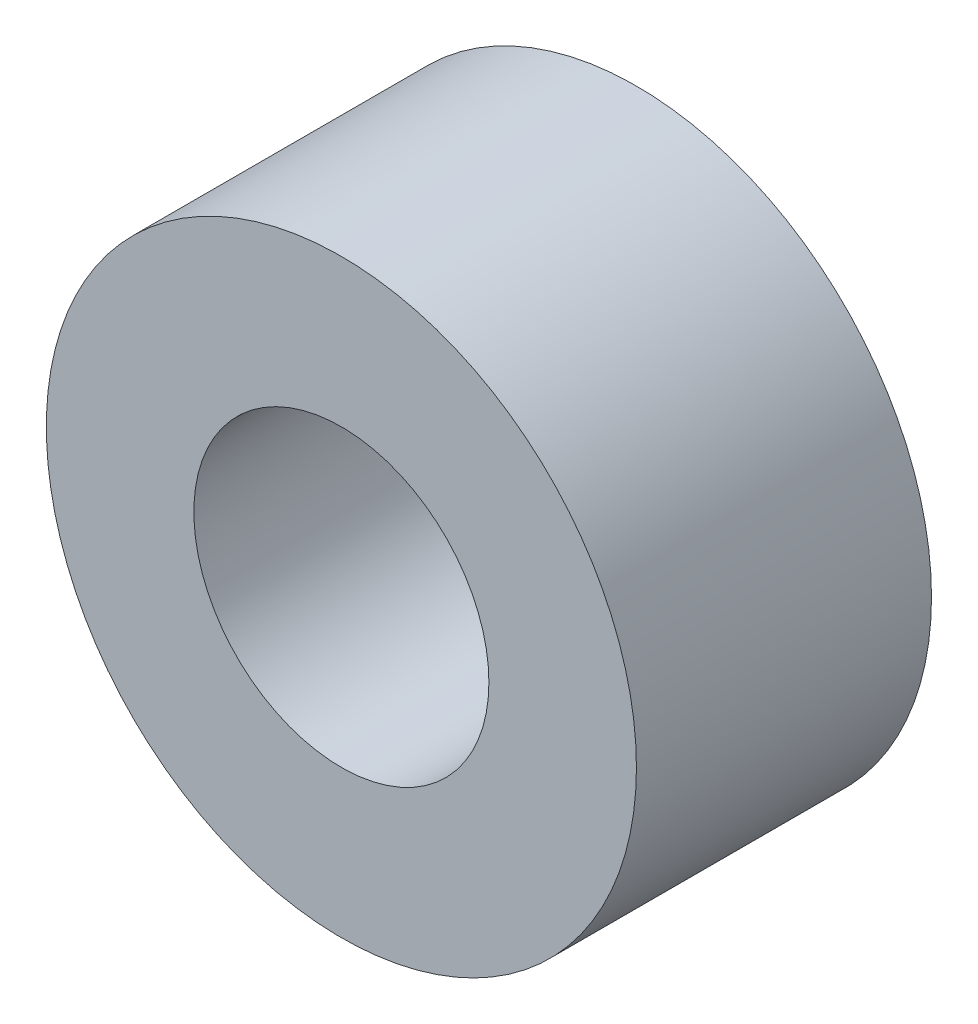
from build123d import *

# Parameters (mm, degrees)
SKETCH1_R           = 3.175
SKETCH1_R_2         = 1.5875
BOSS_EXTRUDE1_DEPTH = 3.175


with BuildPart() as part:
    # Sketch1 → Boss-Extrude1 (new body)
    with BuildSketch(Plane.XY):
        Circle(SKETCH1_R)
        Circle(SKETCH1_R_2, mode=Mode.SUBTRACT)
    extrude(amount=BOSS_EXTRUDE1_DEPTH)


solid = part.part
